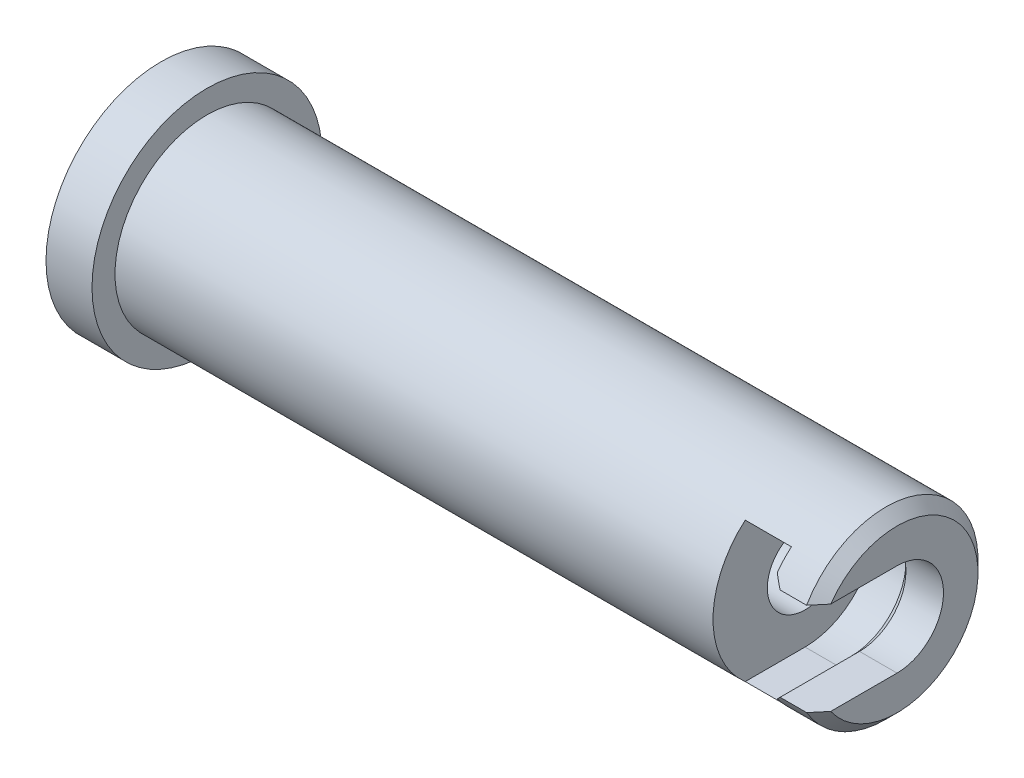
ISO-10303-21;
HEADER;
FILE_DESCRIPTION(('STEP AP214'),'2;1');
FILE_NAME('part.step','',(''),(''),'','','');
FILE_SCHEMA(('AUTOMOTIVE_DESIGN { 1 0 10303 214 1 1 1 1 }'));
ENDSEC;
DATA;
#1=APPLICATION_CONTEXT('core data for automotive mechanical design processes');
#2=APPLICATION_PROTOCOL_DEFINITION('international standard','automotive_design',2000,#1);
#3=PRODUCT_CONTEXT('',#1,'mechanical');
#4=PRODUCT('Part','Part','',(#3));
#5=PRODUCT_RELATED_PRODUCT_CATEGORY('part','',(#4));
#6=PRODUCT_DEFINITION_FORMATION('','',#4);
#7=PRODUCT_DEFINITION_CONTEXT('part definition',#1,'design');
#8=PRODUCT_DEFINITION('design','',#6,#7);
#9=PRODUCT_DEFINITION_SHAPE('','',#8);
#10=(LENGTH_UNIT() NAMED_UNIT(*) SI_UNIT(.MILLI.,.METRE.));
#11=(NAMED_UNIT(*) PLANE_ANGLE_UNIT() SI_UNIT($,.RADIAN.));
#12=(NAMED_UNIT(*) SI_UNIT($,.STERADIAN.) SOLID_ANGLE_UNIT());
#13=UNCERTAINTY_MEASURE_WITH_UNIT(LENGTH_MEASURE(1.E-05),#10,'distance_accuracy_value','');
#14=(GEOMETRIC_REPRESENTATION_CONTEXT(3) GLOBAL_UNCERTAINTY_ASSIGNED_CONTEXT((#13)) GLOBAL_UNIT_ASSIGNED_CONTEXT((#10,
#11,#12)) REPRESENTATION_CONTEXT('',''));
#15=CARTESIAN_POINT('',(0.,0.,0.));
#16=DIRECTION('',(0.,0.,1.));
#17=DIRECTION('',(1.,0.,0.));
#18=AXIS2_PLACEMENT_3D('',#15,#16,#17);
#19=CARTESIAN_POINT('',(63.5,0.,0.));
#20=DIRECTION('',(-1.,0.,0.));
#21=DIRECTION('',(0.,-1.,0.));
#22=AXIS2_PLACEMENT_3D('',#19,#20,#21);
#23=CYLINDRICAL_SURFACE('',#22,9.652);
#24=DIRECTION('',(-1.,0.,0.));
#25=VECTOR('',#24,1.);
#26=CARTESIAN_POINT('',(95.2754,9.652,0.));
#27=LINE('',#26,#25);
#28=CARTESIAN_POINT('',(95.2754,9.652,0.));
#29=VERTEX_POINT('',#28);
#30=CARTESIAN_POINT('',(88.9,9.652,0.));
#31=VERTEX_POINT('',#30);
#32=EDGE_CURVE('E131',#29,#31,#27,.T.);
#33=ORIENTED_EDGE('',*,*,#32,.T.);
#34=CARTESIAN_POINT('',(88.9,0.,0.));
#35=DIRECTION('',(-1.,0.,0.));
#36=DIRECTION('',(0.,-1.,0.));
#37=AXIS2_PLACEMENT_3D('',#34,#35,#36);
#38=CIRCLE('',#37,9.652);
#39=CARTESIAN_POINT('',(88.9,-9.652,0.));
#40=VERTEX_POINT('',#39);
#41=EDGE_CURVE('E115',#31,#40,#38,.T.);
#42=ORIENTED_EDGE('',*,*,#41,.T.);
#43=DIRECTION('',(1.,0.,0.));
#44=VECTOR('',#43,1.);
#45=CARTESIAN_POINT('',(88.9,-9.652,0.));
#46=LINE('',#45,#44);
#47=CARTESIAN_POINT('',(95.2754,-9.652,0.));
#48=VERTEX_POINT('',#47);
#49=EDGE_CURVE('E122',#40,#48,#46,.T.);
#50=ORIENTED_EDGE('',*,*,#49,.T.);
#51=CARTESIAN_POINT('',(95.2754,0.,0.));
#52=DIRECTION('',(-1.,0.,0.));
#53=DIRECTION('',(0.,-1.,0.));
#54=AXIS2_PLACEMENT_3D('',#51,#52,#53);
#55=CIRCLE('',#54,9.652);
#56=EDGE_CURVE('E133',#29,#48,#55,.T.);
#57=ORIENTED_EDGE('',*,*,#56,.F.);
#58=EDGE_LOOP('',(#33,#42,#50,#57));
#59=FACE_BOUND('',#58,.T.);
#60=ADVANCED_FACE('F30',(#59),#23,.F.);
#61=CARTESIAN_POINT('',(95.2754,9.652,0.));
#62=DIRECTION('',(1.,0.,0.));
#63=DIRECTION('',(0.,1.,0.));
#64=AXIS2_PLACEMENT_3D('',#61,#62,#63);
#65=PLANE('',#64);
#66=DIRECTION('',(0.,0.,-1.));
#67=VECTOR('',#66,1.);
#68=CARTESIAN_POINT('',(95.2754,-7.55650000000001,15.875));
#69=LINE('',#68,#67);
#70=CARTESIAN_POINT('',(95.2754,-7.55650000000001,10.2073163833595));
#71=VERTEX_POINT('',#70);
#72=CARTESIAN_POINT('',(95.2754,-7.55650000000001,0.));
#73=VERTEX_POINT('',#72);
#74=EDGE_CURVE('E170',#71,#73,#69,.T.);
#75=ORIENTED_EDGE('',*,*,#74,.T.);
#76=CARTESIAN_POINT('',(95.2754,0.,0.));
#77=DIRECTION('',(-1.,0.,0.));
#78=DIRECTION('',(0.,-1.,0.));
#79=AXIS2_PLACEMENT_3D('',#76,#77,#78);
#80=CIRCLE('',#79,7.5565);
#81=CARTESIAN_POINT('',(95.2754,7.55650000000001,0.));
#82=VERTEX_POINT('',#81);
#83=EDGE_CURVE('E138',#82,#73,#80,.T.);
#84=ORIENTED_EDGE('',*,*,#83,.F.);
#85=DIRECTION('',(0.,0.,-1.));
#86=VECTOR('',#85,1.);
#87=CARTESIAN_POINT('',(95.2754,7.55650000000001,15.875));
#88=LINE('',#87,#86);
#89=CARTESIAN_POINT('',(95.2754,7.55650000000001,10.2073163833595));
#90=VERTEX_POINT('',#89);
#91=EDGE_CURVE('E216',#90,#82,#88,.T.);
#92=ORIENTED_EDGE('',*,*,#91,.F.);
#93=CARTESIAN_POINT('',(95.2754,0.,0.));
#94=DIRECTION('',(-1.,0.,0.));
#95=DIRECTION('',(0.,0.,1.));
#96=AXIS2_PLACEMENT_3D('',#93,#94,#95);
#97=CIRCLE('',#96,12.7);
#98=CARTESIAN_POINT('',(95.2754,9.652,8.25402301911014));
#99=VERTEX_POINT('',#98);
#100=EDGE_CURVE('E152',#90,#99,#97,.T.);
#101=ORIENTED_EDGE('',*,*,#100,.T.);
#102=DIRECTION('',(0.,0.,-1.));
#103=VECTOR('',#102,1.);
#104=CARTESIAN_POINT('',(95.2754,9.652,15.875));
#105=LINE('',#104,#103);
#106=EDGE_CURVE('E45',#99,#29,#105,.T.);
#107=ORIENTED_EDGE('',*,*,#106,.T.);
#108=ORIENTED_EDGE('',*,*,#56,.T.);
#109=DIRECTION('',(0.,0.,-1.));
#110=VECTOR('',#109,1.);
#111=CARTESIAN_POINT('',(95.2754,-9.652,15.875));
#112=LINE('',#111,#110);
#113=CARTESIAN_POINT('',(95.2754,-9.652,8.25402301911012));
#114=VERTEX_POINT('',#113);
#115=EDGE_CURVE('E119',#114,#48,#112,.T.);
#116=ORIENTED_EDGE('',*,*,#115,.F.);
#117=CARTESIAN_POINT('',(95.2754,0.,0.));
#118=DIRECTION('',(-1.,0.,0.));
#119=DIRECTION('',(0.,0.,1.));
#120=AXIS2_PLACEMENT_3D('',#117,#118,#119);
#121=CIRCLE('',#120,12.7);
#122=EDGE_CURVE('E161',#114,#71,#121,.T.);
#123=ORIENTED_EDGE('',*,*,#122,.T.);
#124=EDGE_LOOP('',(#75,#84,#92,#101,#107,#108,#116,#123));
#125=FACE_BOUND('',#124,.T.);
#126=ADVANCED_FACE('F215',(#125),#65,.F.);
#127=CARTESIAN_POINT('',(95.2754,0.,0.));
#128=DIRECTION('',(-1.,0.,0.));
#129=DIRECTION('',(0.,-1.,0.));
#130=AXIS2_PLACEMENT_3D('',#127,#128,#129);
#131=CONICAL_SURFACE('',#130,7.55650000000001,0.78539816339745);
#132=DIRECTION('',(-0.707106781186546,0.707106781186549,0.));
#133=VECTOR('',#132,1.);
#134=CARTESIAN_POINT('',(96.4184,6.4135,0.));
#135=LINE('',#134,#133);
#136=CARTESIAN_POINT('',(96.4184,6.4135,0.));
#137=VERTEX_POINT('',#136);
#138=EDGE_CURVE('E212',#137,#82,#135,.T.);
#139=ORIENTED_EDGE('',*,*,#138,.T.);
#140=ORIENTED_EDGE('',*,*,#83,.T.);
#141=DIRECTION('',(0.707106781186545,0.70710678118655,0.));
#142=VECTOR('',#141,1.);
#143=CARTESIAN_POINT('',(95.2754,-7.55650000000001,0.));
#144=LINE('',#143,#142);
#145=CARTESIAN_POINT('',(96.4184,-6.4135,0.));
#146=VERTEX_POINT('',#145);
#147=EDGE_CURVE('E128',#73,#146,#144,.T.);
#148=ORIENTED_EDGE('',*,*,#147,.T.);
#149=CARTESIAN_POINT('',(96.4184,0.,0.));
#150=DIRECTION('',(-1.,0.,0.));
#151=DIRECTION('',(0.,-1.,0.));
#152=AXIS2_PLACEMENT_3D('',#149,#150,#151);
#153=CIRCLE('',#152,6.4135);
#154=EDGE_CURVE('E203',#137,#146,#153,.T.);
#155=ORIENTED_EDGE('',*,*,#154,.F.);
#156=EDGE_LOOP('',(#139,#140,#148,#155));
#157=FACE_BOUND('',#156,.T.);
#158=ADVANCED_FACE('F209',(#157),#131,.F.);
#159=CARTESIAN_POINT('',(63.5,0.,0.));
#160=DIRECTION('',(-1.,0.,0.));
#161=DIRECTION('',(0.,-1.,0.));
#162=AXIS2_PLACEMENT_3D('',#159,#160,#161);
#163=CYLINDRICAL_SURFACE('',#162,6.4135);
#164=DIRECTION('',(-1.,0.,0.));
#165=VECTOR('',#164,1.);
#166=CARTESIAN_POINT('',(101.6,6.4135,0.));
#167=LINE('',#166,#165);
#168=CARTESIAN_POINT('',(101.6,6.4135,0.));
#169=VERTEX_POINT('',#168);
#170=EDGE_CURVE('E220',#169,#137,#167,.T.);
#171=ORIENTED_EDGE('',*,*,#170,.T.);
#172=ORIENTED_EDGE('',*,*,#154,.T.);
#173=DIRECTION('',(1.,0.,0.));
#174=VECTOR('',#173,1.);
#175=CARTESIAN_POINT('',(96.4184,-6.4135,0.));
#176=LINE('',#175,#174);
#177=CARTESIAN_POINT('',(101.6,-6.4135,0.));
#178=VERTEX_POINT('',#177);
#179=EDGE_CURVE('E178',#146,#178,#176,.T.);
#180=ORIENTED_EDGE('',*,*,#179,.T.);
#181=CARTESIAN_POINT('',(101.6,0.,0.));
#182=DIRECTION('',(-1.,0.,0.));
#183=DIRECTION('',(0.,-1.,0.));
#184=AXIS2_PLACEMENT_3D('',#181,#182,#183);
#185=CIRCLE('',#184,6.4135);
#186=EDGE_CURVE('E194',#169,#178,#185,.T.);
#187=ORIENTED_EDGE('',*,*,#186,.F.);
#188=EDGE_LOOP('',(#171,#172,#180,#187));
#189=FACE_BOUND('',#188,.T.);
#190=ADVANCED_FACE('F314',(#189),#163,.F.);
#191=CARTESIAN_POINT('',(101.6,6.4135,0.));
#192=DIRECTION('',(-1.,0.,0.));
#193=DIRECTION('',(0.,-1.,0.));
#194=AXIS2_PLACEMENT_3D('',#191,#192,#193);
#195=PLANE('',#194);
#196=DIRECTION('',(0.,0.,-1.));
#197=VECTOR('',#196,1.);
#198=CARTESIAN_POINT('',(101.6,-6.4135,15.875));
#199=LINE('',#198,#197);
#200=CARTESIAN_POINT('',(101.6,-6.4135,9.15259491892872));
#201=VERTEX_POINT('',#200);
#202=EDGE_CURVE('E180',#201,#178,#199,.T.);
#203=ORIENTED_EDGE('',*,*,#202,.F.);
#204=CARTESIAN_POINT('',(101.6,0.,0.));
#205=DIRECTION('',(-1.,0.,0.));
#206=DIRECTION('',(0.,-1.,0.));
#207=AXIS2_PLACEMENT_3D('',#204,#205,#206);
#208=CIRCLE('',#207,11.176);
#209=CARTESIAN_POINT('',(101.6,6.4135,9.15259491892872));
#210=VERTEX_POINT('',#209);
#211=EDGE_CURVE('E190',#210,#201,#208,.T.);
#212=ORIENTED_EDGE('',*,*,#211,.F.);
#213=DIRECTION('',(0.,0.,-1.));
#214=VECTOR('',#213,1.);
#215=CARTESIAN_POINT('',(101.6,6.4135,15.875));
#216=LINE('',#215,#214);
#217=EDGE_CURVE('E233',#210,#169,#216,.T.);
#218=ORIENTED_EDGE('',*,*,#217,.T.);
#219=ORIENTED_EDGE('',*,*,#186,.T.);
#220=EDGE_LOOP('',(#203,#212,#218,#219));
#221=FACE_BOUND('',#220,.T.);
#222=ADVANCED_FACE('F278',(#221),#195,.F.);
#223=CARTESIAN_POINT('',(101.6,0.,0.));
#224=DIRECTION('',(-1.,0.,0.));
#225=DIRECTION('',(0.,-1.,0.));
#226=AXIS2_PLACEMENT_3D('',#223,#224,#225);
#227=CONICAL_SURFACE('',#226,11.176,0.785398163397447);
#228=CARTESIAN_POINT('',(92.4011321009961,-6.4135,19.3391380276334));
#229=CARTESIAN_POINT('',(92.704920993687,-6.4135,19.01906990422));
#230=CARTESIAN_POINT('',(93.0083262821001,-6.4135,18.6986368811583));
#231=CARTESIAN_POINT('',(93.6142256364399,-6.4135,18.0569069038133));
#232=CARTESIAN_POINT('',(93.9167196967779,-6.4135,17.7356099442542));
#233=CARTESIAN_POINT('',(94.5211154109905,-6.4135,17.0915246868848));
#234=CARTESIAN_POINT('',(94.8230154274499,-6.4135,16.7687348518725));
#235=CARTESIAN_POINT('',(95.4255623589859,-6.4135,16.1219886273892));
#236=CARTESIAN_POINT('',(95.7262092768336,-6.4135,15.7980322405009));
#237=CARTESIAN_POINT('',(96.3434260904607,-6.4135,15.129897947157));
#238=CARTESIAN_POINT('',(96.6599071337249,-6.4135,14.7856379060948));
#239=CARTESIAN_POINT('',(97.2908467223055,-6.4135,14.0952697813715));
#240=CARTESIAN_POINT('',(97.6053052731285,-6.4135,13.7491617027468));
#241=CARTESIAN_POINT('',(98.2312707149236,-6.4135,13.0552128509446));
#242=CARTESIAN_POINT('',(98.5427812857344,-6.4135,12.707375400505));
#243=CARTESIAN_POINT('',(99.162697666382,-6.4135,12.0089512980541));
#244=CARTESIAN_POINT('',(99.4711035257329,-6.4135,11.6583646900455));
#245=CARTESIAN_POINT('',(100.083337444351,-6.4135,10.9544888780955));
#246=CARTESIAN_POINT('',(100.387173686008,-6.4135,10.6012068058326));
#247=CARTESIAN_POINT('',(100.989770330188,-6.4135,9.89028906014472));
#248=CARTESIAN_POINT('',(101.288530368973,-6.4135,9.53265307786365));
#249=CARTESIAN_POINT('',(101.880721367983,-6.4135,8.81007009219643));
#250=CARTESIAN_POINT('',(102.174119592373,-6.4135,8.44509610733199));
#251=CARTESIAN_POINT('',(102.607133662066,-6.4135,7.89214155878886));
#252=CARTESIAN_POINT('',(102.750278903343,-6.4135,7.70692425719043));
#253=CARTESIAN_POINT('',(103.033764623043,-6.4135,7.334358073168));
#254=CARTESIAN_POINT('',(103.174105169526,-6.4135,7.14700924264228));
#255=CARTESIAN_POINT('',(103.44742684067,-6.4135,6.77530031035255));
#256=CARTESIAN_POINT('',(103.580503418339,-6.4135,6.59101052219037));
#257=CARTESIAN_POINT('',(103.842857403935,-6.4135,6.21975172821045));
#258=CARTESIAN_POINT('',(103.97213498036,-6.4135,6.03278284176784));
#259=CARTESIAN_POINT('',(104.226235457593,-6.4135,5.65552456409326));
#260=CARTESIAN_POINT('',(104.351053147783,-6.4135,5.46523165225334));
#261=CARTESIAN_POINT('',(104.595042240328,-6.4135,5.08105390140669));
#262=CARTESIAN_POINT('',(104.714213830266,-6.4135,4.88716918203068));
#263=CARTESIAN_POINT('',(104.944621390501,-6.4135,4.49690026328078));
#264=CARTESIAN_POINT('',(105.055915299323,-6.4135,4.30055043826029));
#265=CARTESIAN_POINT('',(105.270008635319,-6.4135,3.90319647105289));
#266=CARTESIAN_POINT('',(105.372806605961,-6.4135,3.70219153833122));
#267=CARTESIAN_POINT('',(105.567557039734,-6.4135,3.29552152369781));
#268=CARTESIAN_POINT('',(105.659533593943,-6.4135,3.08986805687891));
#269=CARTESIAN_POINT('',(105.830299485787,-6.4135,2.67317016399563));
#270=CARTESIAN_POINT('',(105.909094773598,-6.4135,2.46212822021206));
#271=CARTESIAN_POINT('',(106.010640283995,-6.4135,2.15519163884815));
#272=CARTESIAN_POINT('',(106.039946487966,-6.4135,2.06144422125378));
#273=CARTESIAN_POINT('',(106.095216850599,-6.4135,1.87296513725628));
#274=CARTESIAN_POINT('',(106.121181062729,-6.4135,1.77823348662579));
#275=CARTESIAN_POINT('',(106.169514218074,-6.4135,1.58781372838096));
#276=CARTESIAN_POINT('',(106.191881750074,-6.4135,1.49212526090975));
#277=CARTESIAN_POINT('',(106.232766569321,-6.4135,1.29990503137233));
#278=CARTESIAN_POINT('',(106.251282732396,-6.4135,1.20337303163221));
#279=CARTESIAN_POINT('',(106.300531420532,-6.4135,0.913645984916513));
#280=CARTESIAN_POINT('',(106.325208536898,-6.4135,0.71937293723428));
#281=CARTESIAN_POINT('',(106.356985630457,-6.4135,0.329423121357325));
#282=CARTESIAN_POINT('',(106.364088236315,-6.4135,0.133746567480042));
#283=CARTESIAN_POINT('',(106.360311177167,-6.4135,-0.257875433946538));
#284=CARTESIAN_POINT('',(106.349391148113,-6.4135,-0.45382050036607));
#285=CARTESIAN_POINT('',(106.310126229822,-6.4135,-0.843938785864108));
#286=CARTESIAN_POINT('',(106.281780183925,-6.4135,-1.03811188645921));
#287=CARTESIAN_POINT('',(106.208980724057,-6.4135,-1.42441504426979));
#288=CARTESIAN_POINT('',(106.164444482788,-6.4135,-1.616529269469));
#289=CARTESIAN_POINT('',(106.061309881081,-6.4135,-1.99690313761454));
#290=CARTESIAN_POINT('',(106.002710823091,-6.4135,-2.18516258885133));
#291=CARTESIAN_POINT('',(105.86585480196,-6.4135,-2.57980220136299));
#292=CARTESIAN_POINT('',(105.786084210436,-6.4135,-2.78565310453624));
#293=CARTESIAN_POINT('',(105.614337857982,-6.4135,-3.19224192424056));
#294=CARTESIAN_POINT('',(105.522356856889,-6.4135,-3.39297760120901));
#295=CARTESIAN_POINT('',(105.328408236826,-6.4135,-3.78994512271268));
#296=CARTESIAN_POINT('',(105.226424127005,-6.4135,-3.98616884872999));
#297=CARTESIAN_POINT('',(105.014529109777,-6.4135,-4.37422731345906));
#298=CARTESIAN_POINT('',(104.904619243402,-6.4135,-4.56606262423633));
#299=CARTESIAN_POINT('',(104.678017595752,-6.4135,-4.94648860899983));
#300=CARTESIAN_POINT('',(104.561305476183,-6.4135,-5.1350671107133));
#301=CARTESIAN_POINT('',(104.322611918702,-6.4135,-5.50885362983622));
#302=CARTESIAN_POINT('',(104.200630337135,-6.4135,-5.69406155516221));
#303=CARTESIAN_POINT('',(103.952451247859,-6.4135,-6.06138114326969));
#304=CARTESIAN_POINT('',(103.826257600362,-6.4135,-6.24349542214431));
#305=CARTESIAN_POINT('',(103.570285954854,-6.4135,-6.6051881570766));
#306=CARTESIAN_POINT('',(103.440507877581,-6.4135,-6.78476655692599));
#307=CARTESIAN_POINT('',(103.221147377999,-6.4135,-7.08299399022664));
#308=CARTESIAN_POINT('',(103.13238825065,-6.4135,-7.20225058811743));
#309=CARTESIAN_POINT('',(102.95398364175,-6.4135,-7.43942789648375));
#310=CARTESIAN_POINT('',(102.864342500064,-6.4135,-7.55735187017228));
#311=CARTESIAN_POINT('',(102.774171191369,-6.4135,-7.67486789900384));
#312=B_SPLINE_CURVE_WITH_KNOTS('',3,(#228,#229,#230,#231,#232,#233,#234,#235,#236,#237,#238,
#239,#240,#241,#242,#243,#244,#245,#246,#247,#248,#249,#250,#251,#252,#253,#254,#255,#256,#257,
#258,#259,#260,#261,#262,#263,#264,#265,#266,#267,#268,#269,#270,#271,#272,#273,#274,#275,#276,
#277,#278,#279,#280,#281,#282,#283,#284,#285,#286,#287,#288,#289,#290,#291,#292,#293,#294,#295,
#296,#297,#298,#299,#300,#301,#302,#303,#304,#305,#306,#307,#308,#309,#310,#311),.UNSPECIFIED.,
.F.,.F.,(4,2,2,2,2,2,2,2,2,2,2,2,2,2,2,2,2,2,2,2,2,2,2,2,2,2,2,2,2,2,2,2,2,2,2,2,2,2,2,2,2,4),
(0.,1.3238516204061,2.64771134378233,3.97361650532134,5.29951873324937,6.70239382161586,
8.10526508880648,9.50605998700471,10.9068325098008,12.3046936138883,13.7026544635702,
15.1073719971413,15.8096076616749,16.5118262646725,17.193731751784,17.8756069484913,
18.5582543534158,19.2408790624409,19.9178055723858,20.5948478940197,21.2703532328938,
21.9455528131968,22.2401668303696,22.5347761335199,22.82950075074,23.1243112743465,
23.7110073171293,24.2976156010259,24.8855394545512,25.4735023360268,26.0645165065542,
26.6555599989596,27.317371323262,27.9794675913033,28.6426743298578,29.3057941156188,
29.9710098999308,30.6362438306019,31.3008839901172,31.9655388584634,32.4115170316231,
32.8558900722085),.UNSPECIFIED.);
#313=CARTESIAN_POINT('',(100.076,-6.41349999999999,10.9616156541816));
#314=VERTEX_POINT('',#313);
#315=EDGE_CURVE('E244',#314,#201,#312,.T.);
#316=ORIENTED_EDGE('',*,*,#315,.F.);
#317=CARTESIAN_POINT('',(100.076,0.,0.));
#318=DIRECTION('',(-1.,0.,0.));
#319=DIRECTION('',(0.,-1.,0.));
#320=AXIS2_PLACEMENT_3D('',#317,#318,#319);
#321=CIRCLE('',#320,12.7);
#322=CARTESIAN_POINT('',(100.076,6.4135,10.9616156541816));
#323=VERTEX_POINT('',#322);
#324=EDGE_CURVE('E186',#323,#314,#321,.T.);
#325=ORIENTED_EDGE('',*,*,#324,.F.);
#326=CARTESIAN_POINT('',(102.774171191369,6.4135,-7.67486789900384));
#327=CARTESIAN_POINT('',(102.918364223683,6.4135,-7.48691262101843));
#328=CARTESIAN_POINT('',(103.061235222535,6.4135,-7.29792635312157));
#329=CARTESIAN_POINT('',(103.343720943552,6.4135,-6.91746525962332));
#330=CARTESIAN_POINT('',(103.483334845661,6.4135,-6.72598982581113));
#331=CARTESIAN_POINT('',(103.75975983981,6.4135,-6.33862212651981));
#332=CARTESIAN_POINT('',(103.896538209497,6.4135,-6.14270643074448));
#333=CARTESIAN_POINT('',(104.165179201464,6.4135,-5.74754403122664));
#334=CARTESIAN_POINT('',(104.297042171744,6.4135,-5.54829756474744));
#335=CARTESIAN_POINT('',(104.56349398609,6.4135,-5.13220567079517));
#336=CARTESIAN_POINT('',(104.697656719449,6.4135,-4.91508591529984));
#337=CARTESIAN_POINT('',(104.957264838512,6.4135,-4.47561022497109));
#338=CARTESIAN_POINT('',(105.082708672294,6.4135,-4.25325336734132));
#339=CARTESIAN_POINT('',(105.322032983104,6.4135,-3.80326614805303));
#340=CARTESIAN_POINT('',(105.43594927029,6.4135,-3.5756549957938));
#341=CARTESIAN_POINT('',(105.64947734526,6.4135,-3.1138753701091));
#342=CARTESIAN_POINT('',(105.749096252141,6.4135,-2.87971023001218));
#343=CARTESIAN_POINT('',(105.926027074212,6.4135,-2.41518176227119));
#344=CARTESIAN_POINT('',(106.004148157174,6.4135,-2.18513080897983));
#345=CARTESIAN_POINT('',(106.139877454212,6.4135,-1.71895016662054));
#346=CARTESIAN_POINT('',(106.197486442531,6.4135,-1.48282070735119));
#347=CARTESIAN_POINT('',(106.287395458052,6.4135,-1.01070544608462));
#348=CARTESIAN_POINT('',(106.320189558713,6.4135,-0.774815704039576));
#349=CARTESIAN_POINT('',(106.35978698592,6.4135,-0.30085100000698));
#350=CARTESIAN_POINT('',(106.366594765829,6.4135,-0.0627764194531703));
#351=CARTESIAN_POINT('',(106.353582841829,6.4135,0.414544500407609));
#352=CARTESIAN_POINT('',(106.333548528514,6.4135,0.653784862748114));
#353=CARTESIAN_POINT('',(106.268185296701,6.4135,1.12875967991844));
#354=CARTESIAN_POINT('',(106.222850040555,6.4135,1.3644932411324));
#355=CARTESIAN_POINT('',(106.109565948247,6.4135,1.83323737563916));
#356=CARTESIAN_POINT('',(106.041362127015,6.4135,2.06618510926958));
#357=CARTESIAN_POINT('',(105.886473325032,6.4135,2.52575681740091));
#358=CARTESIAN_POINT('',(105.799787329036,6.4135,2.75238044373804));
#359=CARTESIAN_POINT('',(105.59249182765,6.4135,3.24491046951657));
#360=CARTESIAN_POINT('',(105.468569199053,6.4135,3.50940874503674));
#361=CARTESIAN_POINT('',(105.204610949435,6.4135,4.03030949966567));
#362=CARTESIAN_POINT('',(105.064565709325,6.4135,4.28670702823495));
#363=CARTESIAN_POINT('',(104.772069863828,6.4135,4.7929818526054));
#364=CARTESIAN_POINT('',(104.619593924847,6.4135,5.04284438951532));
#365=CARTESIAN_POINT('',(104.305427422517,6.4135,5.53659274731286));
#366=CARTESIAN_POINT('',(104.143738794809,6.4135,5.78047980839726));
#367=CARTESIAN_POINT('',(103.811816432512,6.4135,6.26538842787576));
#368=CARTESIAN_POINT('',(103.641521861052,6.4135,6.50636814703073));
#369=CARTESIAN_POINT('',(103.295234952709,6.4135,6.98419707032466));
#370=CARTESIAN_POINT('',(103.119242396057,6.4135,7.22104611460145));
#371=CARTESIAN_POINT('',(102.762968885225,6.4135,7.69098457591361));
#372=CARTESIAN_POINT('',(102.582694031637,6.4135,7.92407863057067));
#373=CARTESIAN_POINT('',(102.218491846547,6.4135,8.38740069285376));
#374=CARTESIAN_POINT('',(102.034564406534,6.4135,8.6176286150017));
#375=CARTESIAN_POINT('',(101.659920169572,6.4135,9.08036729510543));
#376=CARTESIAN_POINT('',(101.469141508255,6.4135,9.31282789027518));
#377=CARTESIAN_POINT('',(101.085016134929,6.4135,9.7756195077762));
#378=CARTESIAN_POINT('',(100.891669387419,6.4135,10.0059505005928));
#379=CARTESIAN_POINT('',(100.30842035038,6.4135,10.6942598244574));
#380=CARTESIAN_POINT('',(99.9153263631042,6.4135,11.14953354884));
#381=CARTESIAN_POINT('',(99.122784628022,6.4135,12.0550862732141));
#382=CARTESIAN_POINT('',(98.7233324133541,6.4135,12.5053613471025));
#383=CARTESIAN_POINT('',(97.9199090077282,6.4135,13.4018653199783));
#384=CARTESIAN_POINT('',(97.5159377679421,6.4135,13.8480941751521));
#385=CARTESIAN_POINT('',(96.7223235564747,6.4135,14.7179410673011));
#386=CARTESIAN_POINT('',(96.3328277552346,6.4135,15.1416935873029));
#387=CARTESIAN_POINT('',(95.5513548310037,6.4135,15.9869106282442));
#388=CARTESIAN_POINT('',(95.1593776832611,6.4135,16.408375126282));
#389=CARTESIAN_POINT('',(94.3739351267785,6.4135,17.248925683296));
#390=CARTESIAN_POINT('',(93.9804721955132,6.4135,17.6680140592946));
#391=CARTESIAN_POINT('',(93.1919294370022,6.4135,18.5046502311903));
#392=CARTESIAN_POINT('',(92.7968496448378,6.4135,18.922198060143));
#393=CARTESIAN_POINT('',(92.4011321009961,6.4135,19.3391380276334));
#394=B_SPLINE_CURVE_WITH_KNOTS('',3,(#326,#327,#328,#329,#330,#331,#332,#333,#334,#335,#336,
#337,#338,#339,#340,#341,#342,#343,#344,#345,#346,#347,#348,#349,#350,#351,#352,#353,#354,#355,
#356,#357,#358,#359,#360,#361,#362,#363,#364,#365,#366,#367,#368,#369,#370,#371,#372,#373,#374,
#375,#376,#377,#378,#379,#380,#381,#382,#383,#384,#385,#386,#387,#388,#389,#390,#391,#392,#393),
.UNSPECIFIED.,.F.,.F.,(4,2,2,2,2,2,2,2,2,2,2,2,2,2,2,2,2,2,2,2,2,2,2,2,2,2,2,2,2,2,2,2,2,4),(0.,
0.710696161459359,1.42156936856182,2.13832073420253,2.85502125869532,3.62053914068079,
4.38619293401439,5.14939009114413,5.91220590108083,6.64028848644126,7.36834358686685,
8.08149100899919,8.79451621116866,9.51327638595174,10.2322166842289,10.9594556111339,
11.6867344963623,12.5622501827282,13.4382909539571,14.3161639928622,15.1938532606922,
16.0789855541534,16.964152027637,17.8481252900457,18.7321248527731,19.6342720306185,
20.5364316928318,22.3408321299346,24.1465616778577,25.9523107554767,27.6789891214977,
29.4056847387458,31.130218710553,32.8547154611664),.UNSPECIFIED.);
#395=EDGE_CURVE('E118',#210,#323,#394,.T.);
#396=ORIENTED_EDGE('',*,*,#395,.F.);
#397=ORIENTED_EDGE('',*,*,#211,.T.);
#398=EDGE_LOOP('',(#316,#325,#396,#397));
#399=FACE_BOUND('',#398,.T.);
#400=ADVANCED_FACE('F249',(#399),#227,.T.);
#401=CARTESIAN_POINT('',(63.5,0.,0.));
#402=DIRECTION('',(-1.,0.,0.));
#403=DIRECTION('',(0.,-1.,0.));
#404=AXIS2_PLACEMENT_3D('',#401,#402,#403);
#405=CYLINDRICAL_SURFACE('',#404,12.7);
#406=CARTESIAN_POINT('',(6.34999999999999,0.,0.));
#407=DIRECTION('',(-1.,0.,0.));
#408=DIRECTION('',(0.,-1.,0.));
#409=AXIS2_PLACEMENT_3D('',#406,#407,#408);
#410=CIRCLE('',#409,12.7);
#411=CARTESIAN_POINT('',(6.35,-12.7,0.));
#412=VERTEX_POINT('',#411);
#413=EDGE_CURVE('E191',#412,#412,#410,.T.);
#414=ORIENTED_EDGE('',*,*,#413,.F.);
#415=EDGE_LOOP('',(#414));
#416=FACE_BOUND('',#415,.T.);
#417=DIRECTION('',(-1.,0.,0.));
#418=VECTOR('',#417,1.);
#419=CARTESIAN_POINT('',(63.5,-6.4135,10.9616156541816));
#420=LINE('',#419,#418);
#421=CARTESIAN_POINT('',(96.4184,-6.4135,10.9616156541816));
#422=VERTEX_POINT('',#421);
#423=EDGE_CURVE('E11',#422,#314,#420,.F.);
#424=ORIENTED_EDGE('',*,*,#423,.F.);
#425=CARTESIAN_POINT('',(102.8319,0.,0.));
#426=DIRECTION('',(-0.70710678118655,0.707106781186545,0.));
#427=DIRECTION('',(-0.707106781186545,-0.70710678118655,0.));
#428=AXIS2_PLACEMENT_3D('',#425,#426,#427);
#429=ELLIPSE('',#428,17.9605122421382,12.7);
#430=EDGE_CURVE('E38',#71,#422,#429,.T.);
#431=ORIENTED_EDGE('',*,*,#430,.F.);
#432=ORIENTED_EDGE('',*,*,#122,.F.);
#433=DIRECTION('',(-1.,0.,0.));
#434=VECTOR('',#433,1.);
#435=CARTESIAN_POINT('',(63.5,-9.652,8.25402301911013));
#436=LINE('',#435,#434);
#437=CARTESIAN_POINT('',(88.9,-9.652,8.25402301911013));
#438=VERTEX_POINT('',#437);
#439=EDGE_CURVE('E159',#438,#114,#436,.F.);
#440=ORIENTED_EDGE('',*,*,#439,.F.);
#441=CARTESIAN_POINT('',(88.9,0.,0.));
#442=DIRECTION('',(1.,0.,0.));
#443=DIRECTION('',(0.,0.,-1.));
#444=AXIS2_PLACEMENT_3D('',#441,#442,#443);
#445=CIRCLE('',#444,12.7);
#446=CARTESIAN_POINT('',(88.9,9.652,8.25402301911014));
#447=VERTEX_POINT('',#446);
#448=EDGE_CURVE('E53',#447,#438,#445,.T.);
#449=ORIENTED_EDGE('',*,*,#448,.F.);
#450=DIRECTION('',(-1.,0.,0.));
#451=VECTOR('',#450,1.);
#452=CARTESIAN_POINT('',(63.5,9.65199999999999,8.25402301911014));
#453=LINE('',#452,#451);
#454=EDGE_CURVE('E150',#99,#447,#453,.T.);
#455=ORIENTED_EDGE('',*,*,#454,.F.);
#456=ORIENTED_EDGE('',*,*,#100,.F.);
#457=CARTESIAN_POINT('',(102.8319,0.,0.));
#458=DIRECTION('',(-0.707106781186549,-0.707106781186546,0.));
#459=DIRECTION('',(-0.707106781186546,0.707106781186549,0.));
#460=AXIS2_PLACEMENT_3D('',#457,#458,#459);
#461=ELLIPSE('',#460,17.9605122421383,12.7);
#462=CARTESIAN_POINT('',(96.4184,6.4135,10.9616156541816));
#463=VERTEX_POINT('',#462);
#464=EDGE_CURVE('E154',#463,#90,#461,.T.);
#465=ORIENTED_EDGE('',*,*,#464,.F.);
#466=DIRECTION('',(-1.,0.,0.));
#467=VECTOR('',#466,1.);
#468=CARTESIAN_POINT('',(63.5,6.4135,10.9616156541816));
#469=LINE('',#468,#467);
#470=EDGE_CURVE('E156',#323,#463,#469,.T.);
#471=ORIENTED_EDGE('',*,*,#470,.F.);
#472=ORIENTED_EDGE('',*,*,#324,.T.);
#473=EDGE_LOOP('',(#424,#431,#432,#440,#449,#455,#456,#465,#471,#472));
#474=FACE_BOUND('',#473,.T.);
#475=ADVANCED_FACE('F183',(#416,#474),#405,.T.);
#476=CARTESIAN_POINT('',(63.5,0.,0.));
#477=DIRECTION('',(-1.,0.,0.));
#478=DIRECTION('',(0.,-1.,0.));
#479=AXIS2_PLACEMENT_3D('',#476,#477,#478);
#480=CYLINDRICAL_SURFACE('',#479,15.875);
#481=CARTESIAN_POINT('',(0.,0.,0.));
#482=DIRECTION('',(-1.,0.,0.));
#483=DIRECTION('',(0.,-1.,0.));
#484=AXIS2_PLACEMENT_3D('',#481,#482,#483);
#485=CIRCLE('',#484,15.875);
#486=CARTESIAN_POINT('',(0.,-15.875,0.));
#487=VERTEX_POINT('',#486);
#488=EDGE_CURVE('E147',#487,#487,#485,.T.);
#489=ORIENTED_EDGE('',*,*,#488,.F.);
#490=EDGE_LOOP('',(#489));
#491=FACE_BOUND('',#490,.T.);
#492=CARTESIAN_POINT('',(6.34999999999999,0.,0.));
#493=DIRECTION('',(-1.,0.,0.));
#494=DIRECTION('',(0.,-1.,0.));
#495=AXIS2_PLACEMENT_3D('',#492,#493,#494);
#496=CIRCLE('',#495,15.875);
#497=CARTESIAN_POINT('',(6.35,-15.875,0.));
#498=VERTEX_POINT('',#497);
#499=EDGE_CURVE('E197',#498,#498,#496,.T.);
#500=ORIENTED_EDGE('',*,*,#499,.T.);
#501=EDGE_LOOP('',(#500));
#502=FACE_BOUND('',#501,.T.);
#503=ADVANCED_FACE('F32',(#491,#502),#480,.T.);
#504=CARTESIAN_POINT('',(0.,15.875,0.));
#505=DIRECTION('',(1.,0.,0.));
#506=DIRECTION('',(0.,1.,0.));
#507=AXIS2_PLACEMENT_3D('',#504,#505,#506);
#508=PLANE('',#507);
#509=CARTESIAN_POINT('',(0.,0.,0.));
#510=DIRECTION('',(-1.,0.,0.));
#511=DIRECTION('',(0.,-1.,0.));
#512=AXIS2_PLACEMENT_3D('',#509,#510,#511);
#513=CIRCLE('',#512,6.73099999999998);
#514=CARTESIAN_POINT('',(0.,-6.73099999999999,0.));
#515=VERTEX_POINT('',#514);
#516=EDGE_CURVE('E144',#515,#515,#513,.T.);
#517=ORIENTED_EDGE('',*,*,#516,.F.);
#518=EDGE_LOOP('',(#517));
#519=FACE_BOUND('',#518,.T.);
#520=ORIENTED_EDGE('',*,*,#488,.T.);
#521=EDGE_LOOP('',(#520));
#522=FACE_BOUND('',#521,.T.);
#523=ADVANCED_FACE('F276',(#519,#522),#508,.F.);
#524=CARTESIAN_POINT('',(0.,0.,0.));
#525=DIRECTION('',(-1.,0.,0.));
#526=DIRECTION('',(0.,-1.,0.));
#527=AXIS2_PLACEMENT_3D('',#524,#525,#526);
#528=CONICAL_SURFACE('',#527,6.73099999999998,0.785398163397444);
#529=CARTESIAN_POINT('',(1.52399999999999,0.,0.));
#530=DIRECTION('',(-1.,0.,0.));
#531=DIRECTION('',(0.,-1.,0.));
#532=AXIS2_PLACEMENT_3D('',#529,#530,#531);
#533=CIRCLE('',#532,5.20700000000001);
#534=CARTESIAN_POINT('',(1.52399999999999,-5.20700000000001,0.));
#535=VERTEX_POINT('',#534);
#536=EDGE_CURVE('E136',#535,#535,#533,.T.);
#537=ORIENTED_EDGE('',*,*,#536,.F.);
#538=EDGE_LOOP('',(#537));
#539=FACE_BOUND('',#538,.T.);
#540=ORIENTED_EDGE('',*,*,#516,.T.);
#541=EDGE_LOOP('',(#540));
#542=FACE_BOUND('',#541,.T.);
#543=ADVANCED_FACE('F294',(#539,#542),#528,.F.);
#544=CARTESIAN_POINT('',(63.5,0.,0.));
#545=DIRECTION('',(-1.,0.,0.));
#546=DIRECTION('',(0.,-1.,0.));
#547=AXIS2_PLACEMENT_3D('',#544,#545,#546);
#548=CYLINDRICAL_SURFACE('',#547,5.207);
#549=CARTESIAN_POINT('',(88.9,0.,0.));
#550=DIRECTION('',(-1.,0.,0.));
#551=DIRECTION('',(0.,-1.,0.));
#552=AXIS2_PLACEMENT_3D('',#549,#550,#551);
#553=CIRCLE('',#552,5.207);
#554=CARTESIAN_POINT('',(88.9,-5.20699999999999,0.));
#555=VERTEX_POINT('',#554);
#556=EDGE_CURVE('E132',#555,#555,#553,.T.);
#557=ORIENTED_EDGE('',*,*,#556,.F.);
#558=EDGE_LOOP('',(#557));
#559=FACE_BOUND('',#558,.T.);
#560=ORIENTED_EDGE('',*,*,#536,.T.);
#561=EDGE_LOOP('',(#560));
#562=FACE_BOUND('',#561,.T.);
#563=ADVANCED_FACE('F290',(#559,#562),#548,.F.);
#564=CARTESIAN_POINT('',(88.9,5.207,0.));
#565=DIRECTION('',(-1.,0.,0.));
#566=DIRECTION('',(0.,-1.,0.));
#567=AXIS2_PLACEMENT_3D('',#564,#565,#566);
#568=PLANE('',#567);
#569=ORIENTED_EDGE('',*,*,#556,.T.);
#570=EDGE_LOOP('',(#569));
#571=FACE_BOUND('',#570,.T.);
#572=DIRECTION('',(0.,0.,-1.));
#573=VECTOR('',#572,1.);
#574=CARTESIAN_POINT('',(88.9,-9.652,15.875));
#575=LINE('',#574,#573);
#576=EDGE_CURVE('E111',#438,#40,#575,.T.);
#577=ORIENTED_EDGE('',*,*,#576,.T.);
#578=ORIENTED_EDGE('',*,*,#41,.F.);
#579=DIRECTION('',(0.,0.,-1.));
#580=VECTOR('',#579,1.);
#581=CARTESIAN_POINT('',(88.9,9.652,15.875));
#582=LINE('',#581,#580);
#583=EDGE_CURVE('E227',#447,#31,#582,.T.);
#584=ORIENTED_EDGE('',*,*,#583,.F.);
#585=ORIENTED_EDGE('',*,*,#448,.T.);
#586=EDGE_LOOP('',(#577,#578,#584,#585));
#587=FACE_BOUND('',#586,.T.);
#588=ADVANCED_FACE('F113',(#571,#587),#568,.F.);
#589=CARTESIAN_POINT('',(6.34999999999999,12.7,0.));
#590=DIRECTION('',(-1.,0.,0.));
#591=DIRECTION('',(0.,-1.,0.));
#592=AXIS2_PLACEMENT_3D('',#589,#590,#591);
#593=PLANE('',#592);
#594=ORIENTED_EDGE('',*,*,#499,.F.);
#595=EDGE_LOOP('',(#594));
#596=FACE_BOUND('',#595,.T.);
#597=ORIENTED_EDGE('',*,*,#413,.T.);
#598=EDGE_LOOP('',(#597));
#599=FACE_BOUND('',#598,.T.);
#600=ADVANCED_FACE('F267',(#596,#599),#593,.F.);
#601=CARTESIAN_POINT('',(88.9,-9.652,15.875));
#602=DIRECTION('',(0.,1.,0.));
#603=DIRECTION('',(0.,0.,1.));
#604=AXIS2_PLACEMENT_3D('',#601,#602,#603);
#605=PLANE('',#604);
#606=ORIENTED_EDGE('',*,*,#439,.T.);
#607=ORIENTED_EDGE('',*,*,#115,.T.);
#608=ORIENTED_EDGE('',*,*,#49,.F.);
#609=ORIENTED_EDGE('',*,*,#576,.F.);
#610=EDGE_LOOP('',(#606,#607,#608,#609));
#611=FACE_BOUND('',#610,.T.);
#612=ADVANCED_FACE('F123',(#611),#605,.T.);
#613=CARTESIAN_POINT('',(95.2754,-7.55650000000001,15.875));
#614=DIRECTION('',(-0.70710678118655,0.707106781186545,0.));
#615=DIRECTION('',(-0.707106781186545,-0.70710678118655,0.));
#616=AXIS2_PLACEMENT_3D('',#613,#614,#615);
#617=PLANE('',#616);
#618=ORIENTED_EDGE('',*,*,#430,.T.);
#619=DIRECTION('',(0.,0.,-1.));
#620=VECTOR('',#619,1.);
#621=CARTESIAN_POINT('',(96.4184,-6.4135,15.875));
#622=LINE('',#621,#620);
#623=EDGE_CURVE('E168',#422,#146,#622,.T.);
#624=ORIENTED_EDGE('',*,*,#623,.T.);
#625=ORIENTED_EDGE('',*,*,#147,.F.);
#626=ORIENTED_EDGE('',*,*,#74,.F.);
#627=EDGE_LOOP('',(#618,#624,#625,#626));
#628=FACE_BOUND('',#627,.T.);
#629=ADVANCED_FACE('F166',(#628),#617,.T.);
#630=CARTESIAN_POINT('',(96.4184,-6.4135,15.875));
#631=DIRECTION('',(0.,1.,0.));
#632=DIRECTION('',(0.,0.,1.));
#633=AXIS2_PLACEMENT_3D('',#630,#631,#632);
#634=PLANE('',#633);
#635=ORIENTED_EDGE('',*,*,#315,.T.);
#636=ORIENTED_EDGE('',*,*,#202,.T.);
#637=ORIENTED_EDGE('',*,*,#179,.F.);
#638=ORIENTED_EDGE('',*,*,#623,.F.);
#639=ORIENTED_EDGE('',*,*,#423,.T.);
#640=EDGE_LOOP('',(#635,#636,#637,#638,#639));
#641=FACE_BOUND('',#640,.T.);
#642=ADVANCED_FACE('F175',(#641),#634,.T.);
#643=CARTESIAN_POINT('',(101.6,6.4135,15.875));
#644=DIRECTION('',(0.,-1.,0.));
#645=DIRECTION('',(1.,0.,0.));
#646=AXIS2_PLACEMENT_3D('',#643,#644,#645);
#647=PLANE('',#646);
#648=ORIENTED_EDGE('',*,*,#395,.T.);
#649=ORIENTED_EDGE('',*,*,#470,.T.);
#650=DIRECTION('',(0.,0.,-1.));
#651=VECTOR('',#650,1.);
#652=CARTESIAN_POINT('',(96.4184,6.4135,15.875));
#653=LINE('',#652,#651);
#654=EDGE_CURVE('E231',#463,#137,#653,.T.);
#655=ORIENTED_EDGE('',*,*,#654,.T.);
#656=ORIENTED_EDGE('',*,*,#170,.F.);
#657=ORIENTED_EDGE('',*,*,#217,.F.);
#658=EDGE_LOOP('',(#648,#649,#655,#656,#657));
#659=FACE_BOUND('',#658,.T.);
#660=ADVANCED_FACE('F253',(#659),#647,.T.);
#661=CARTESIAN_POINT('',(96.4184,6.4135,15.875));
#662=DIRECTION('',(-0.707106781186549,-0.707106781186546,0.));
#663=DIRECTION('',(0.707106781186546,-0.707106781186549,0.));
#664=AXIS2_PLACEMENT_3D('',#661,#662,#663);
#665=PLANE('',#664);
#666=ORIENTED_EDGE('',*,*,#464,.T.);
#667=ORIENTED_EDGE('',*,*,#91,.T.);
#668=ORIENTED_EDGE('',*,*,#138,.F.);
#669=ORIENTED_EDGE('',*,*,#654,.F.);
#670=EDGE_LOOP('',(#666,#667,#668,#669));
#671=FACE_BOUND('',#670,.T.);
#672=ADVANCED_FACE('F257',(#671),#665,.T.);
#673=CARTESIAN_POINT('',(95.2754,9.652,15.875));
#674=DIRECTION('',(0.,-1.,0.));
#675=DIRECTION('',(1.,0.,0.));
#676=AXIS2_PLACEMENT_3D('',#673,#674,#675);
#677=PLANE('',#676);
#678=ORIENTED_EDGE('',*,*,#454,.T.);
#679=ORIENTED_EDGE('',*,*,#583,.T.);
#680=ORIENTED_EDGE('',*,*,#32,.F.);
#681=ORIENTED_EDGE('',*,*,#106,.F.);
#682=EDGE_LOOP('',(#678,#679,#680,#681));
#683=FACE_BOUND('',#682,.T.);
#684=ADVANCED_FACE('F400',(#683),#677,.T.);
#685=CLOSED_SHELL('',(#60,#126,#158,#190,#222,#400,#475,#503,#523,#543,#563,#588,#600,#612,#629,
#642,#660,#672,#684));
#686=MANIFOLD_SOLID_BREP('B2',#685);
#687=ADVANCED_BREP_SHAPE_REPRESENTATION('',(#18,#686),#14);
#688=SHAPE_DEFINITION_REPRESENTATION(#9,#687);
ENDSEC;
END-ISO-10303-21;
